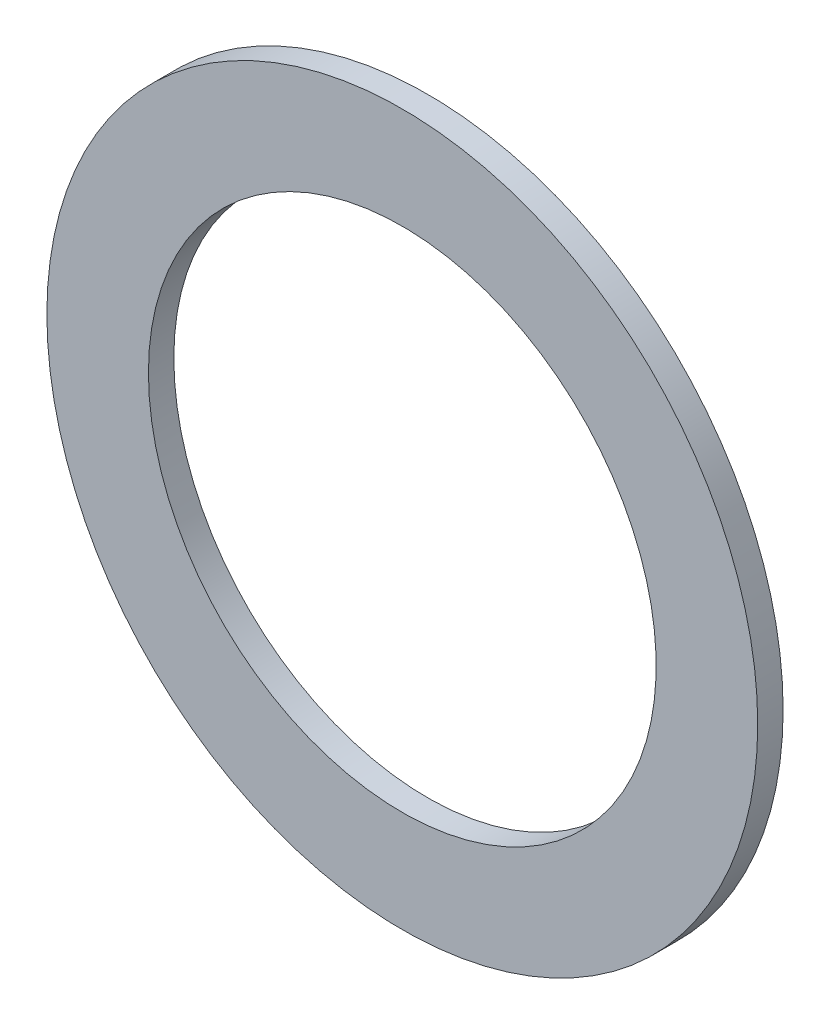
ISO-10303-21;
HEADER;
FILE_DESCRIPTION(('STEP AP214'),'2;1');
FILE_NAME('part.step','',(''),(''),'','','');
FILE_SCHEMA(('AUTOMOTIVE_DESIGN { 1 0 10303 214 1 1 1 1 }'));
ENDSEC;
DATA;
#1=APPLICATION_CONTEXT('core data for automotive mechanical design processes');
#2=APPLICATION_PROTOCOL_DEFINITION('international standard','automotive_design',2000,#1);
#3=PRODUCT_CONTEXT('',#1,'mechanical');
#4=PRODUCT('Part','Part','',(#3));
#5=PRODUCT_RELATED_PRODUCT_CATEGORY('part','',(#4));
#6=PRODUCT_DEFINITION_FORMATION('','',#4);
#7=PRODUCT_DEFINITION_CONTEXT('part definition',#1,'design');
#8=PRODUCT_DEFINITION('design','',#6,#7);
#9=PRODUCT_DEFINITION_SHAPE('','',#8);
#10=(LENGTH_UNIT() NAMED_UNIT(*) SI_UNIT(.MILLI.,.METRE.));
#11=(NAMED_UNIT(*) PLANE_ANGLE_UNIT() SI_UNIT($,.RADIAN.));
#12=(NAMED_UNIT(*) SI_UNIT($,.STERADIAN.) SOLID_ANGLE_UNIT());
#13=UNCERTAINTY_MEASURE_WITH_UNIT(LENGTH_MEASURE(1.E-05),#10,'distance_accuracy_value','');
#14=(GEOMETRIC_REPRESENTATION_CONTEXT(3) GLOBAL_UNCERTAINTY_ASSIGNED_CONTEXT((#13)) GLOBAL_UNIT_ASSIGNED_CONTEXT((#10,
#11,#12)) REPRESENTATION_CONTEXT('',''));
#15=CARTESIAN_POINT('',(0.,0.,0.));
#16=DIRECTION('',(0.,0.,1.));
#17=DIRECTION('',(1.,0.,0.));
#18=AXIS2_PLACEMENT_3D('',#15,#16,#17);
#19=CARTESIAN_POINT('',(0.,0.,3.));
#20=DIRECTION('',(0.,0.,-0.999999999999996));
#21=DIRECTION('',(-1.,0.,0.));
#22=AXIS2_PLACEMENT_3D('',#19,#20,#21);
#23=CYLINDRICAL_SURFACE('',#22,70.);
#24=CARTESIAN_POINT('',(0.,0.,-1.99999999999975));
#25=DIRECTION('',(0.,0.,1.));
#26=DIRECTION('',(1.,0.,0.));
#27=AXIS2_PLACEMENT_3D('',#24,#25,#26);
#28=CIRCLE('',#27,70.);
#29=CARTESIAN_POINT('',(-70.0000000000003,0.,-1.99999999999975));
#30=VERTEX_POINT('',#29);
#31=EDGE_CURVE('E49',#30,#30,#28,.T.);
#32=CARTESIAN_POINT('',(0.,0.,3.));
#33=DIRECTION('',(0.,0.,-0.999999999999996));
#34=DIRECTION('',(-1.,0.,0.));
#35=AXIS2_PLACEMENT_3D('',#32,#33,#34);
#36=CIRCLE('',#35,70.);
#37=CARTESIAN_POINT('',(-70.0000000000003,0.,3.));
#38=VERTEX_POINT('',#37);
#39=EDGE_CURVE('E44',#38,#38,#36,.F.);
#40=CARTESIAN_POINT('',(-70.0000000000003,0.,-1.99999999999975));
#41=CARTESIAN_POINT('',(-70.0000000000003,0.,-1.94791666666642));
#42=CARTESIAN_POINT('',(-70.0000000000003,0.,-1.89583333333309));
#43=CARTESIAN_POINT('',(-70.0000000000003,0.,-1.79166666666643));
#44=CARTESIAN_POINT('',(-70.0000000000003,0.,-1.7395833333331));
#45=CARTESIAN_POINT('',(-70.0000000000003,0.,-1.63541666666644));
#46=CARTESIAN_POINT('',(-70.0000000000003,0.,-1.5833333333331));
#47=CARTESIAN_POINT('',(-70.0000000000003,0.,-1.47916666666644));
#48=CARTESIAN_POINT('',(-70.0000000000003,0.,-1.42708333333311));
#49=CARTESIAN_POINT('',(-70.0000000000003,0.,-1.32291666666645));
#50=CARTESIAN_POINT('',(-70.0000000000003,0.,-1.27083333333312));
#51=CARTESIAN_POINT('',(-70.0000000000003,0.,-1.16666666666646));
#52=CARTESIAN_POINT('',(-70.0000000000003,0.,-1.11458333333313));
#53=CARTESIAN_POINT('',(-70.0000000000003,0.,-1.01041666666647));
#54=CARTESIAN_POINT('',(-70.0000000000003,0.,-0.958333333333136));
#55=CARTESIAN_POINT('',(-70.0000000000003,0.,-0.854166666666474));
#56=CARTESIAN_POINT('',(-70.0000000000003,0.,-0.802083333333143));
#57=CARTESIAN_POINT('',(-70.0000000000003,0.,-0.697916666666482));
#58=CARTESIAN_POINT('',(-70.0000000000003,0.,-0.645833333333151));
#59=CARTESIAN_POINT('',(-70.0000000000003,0.,-0.54166666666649));
#60=CARTESIAN_POINT('',(-70.0000000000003,0.,-0.489583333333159));
#61=CARTESIAN_POINT('',(-70.0000000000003,0.,-0.385416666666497));
#62=CARTESIAN_POINT('',(-70.0000000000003,0.,-0.333333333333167));
#63=CARTESIAN_POINT('',(-70.0000000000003,0.,-0.229166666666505));
#64=CARTESIAN_POINT('',(-70.0000000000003,0.,-0.177083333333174));
#65=CARTESIAN_POINT('',(-70.0000000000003,0.,-0.0729166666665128));
#66=CARTESIAN_POINT('',(-70.0000000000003,0.,-0.020833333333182));
#67=CARTESIAN_POINT('',(-70.0000000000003,0.,0.0833333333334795));
#68=CARTESIAN_POINT('',(-70.0000000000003,0.,0.13541666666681));
#69=CARTESIAN_POINT('',(-70.0000000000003,0.,0.239583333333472));
#70=CARTESIAN_POINT('',(-70.0000000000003,0.,0.291666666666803));
#71=CARTESIAN_POINT('',(-70.0000000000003,0.,0.395833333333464));
#72=CARTESIAN_POINT('',(-70.0000000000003,0.,0.447916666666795));
#73=CARTESIAN_POINT('',(-70.0000000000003,0.,0.552083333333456));
#74=CARTESIAN_POINT('',(-70.0000000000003,0.,0.604166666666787));
#75=CARTESIAN_POINT('',(-70.0000000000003,0.,0.708333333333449));
#76=CARTESIAN_POINT('',(-70.0000000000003,0.,0.76041666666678));
#77=CARTESIAN_POINT('',(-70.0000000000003,0.,0.864583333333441));
#78=CARTESIAN_POINT('',(-70.0000000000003,0.,0.916666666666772));
#79=CARTESIAN_POINT('',(-70.0000000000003,0.,1.02083333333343));
#80=CARTESIAN_POINT('',(-70.0000000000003,0.,1.07291666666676));
#81=CARTESIAN_POINT('',(-70.0000000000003,0.,1.17708333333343));
#82=CARTESIAN_POINT('',(-70.0000000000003,0.,1.22916666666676));
#83=CARTESIAN_POINT('',(-70.0000000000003,0.,1.33333333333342));
#84=CARTESIAN_POINT('',(-70.0000000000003,0.,1.38541666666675));
#85=CARTESIAN_POINT('',(-70.0000000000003,0.,1.48958333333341));
#86=CARTESIAN_POINT('',(-70.0000000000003,0.,1.54166666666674));
#87=CARTESIAN_POINT('',(-70.0000000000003,0.,1.6458333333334));
#88=CARTESIAN_POINT('',(-70.0000000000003,0.,1.69791666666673));
#89=CARTESIAN_POINT('',(-70.0000000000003,0.,1.80208333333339));
#90=CARTESIAN_POINT('',(-70.0000000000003,0.,1.85416666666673));
#91=CARTESIAN_POINT('',(-70.0000000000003,0.,1.95833333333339));
#92=CARTESIAN_POINT('',(-70.0000000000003,0.,2.01041666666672));
#93=CARTESIAN_POINT('',(-70.0000000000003,0.,2.11458333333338));
#94=CARTESIAN_POINT('',(-70.0000000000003,0.,2.16666666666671));
#95=CARTESIAN_POINT('',(-70.0000000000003,0.,2.27083333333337));
#96=CARTESIAN_POINT('',(-70.0000000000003,0.,2.3229166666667));
#97=CARTESIAN_POINT('',(-70.0000000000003,0.,2.42708333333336));
#98=CARTESIAN_POINT('',(-70.0000000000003,0.,2.47916666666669));
#99=CARTESIAN_POINT('',(-70.0000000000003,0.,2.58333333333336));
#100=CARTESIAN_POINT('',(-70.0000000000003,0.,2.63541666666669));
#101=CARTESIAN_POINT('',(-70.0000000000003,0.,2.73958333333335));
#102=CARTESIAN_POINT('',(-70.0000000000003,0.,2.79166666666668));
#103=CARTESIAN_POINT('',(-70.0000000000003,0.,2.89583333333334));
#104=CARTESIAN_POINT('',(-70.0000000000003,0.,2.94791666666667));
#105=CARTESIAN_POINT('',(-70.0000000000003,0.,3.));
#106=B_SPLINE_CURVE_WITH_KNOTS('',3,(#40,#41,#42,#43,#44,#45,#46,#47,#48,#49,#50,#51,#52,#53,
#54,#55,#56,#57,#58,#59,#60,#61,#62,#63,#64,#65,#66,#67,#68,#69,#70,#71,#72,#73,#74,#75,#76,#77,
#78,#79,#80,#81,#82,#83,#84,#85,#86,#87,#88,#89,#90,#91,#92,#93,#94,#95,#96,#97,#98,#99,#100,
#101,#102,#103,#104,#105),.UNSPECIFIED.,.F.,.F.,(4,2,2,2,2,2,2,2,2,2,2,2,2,2,2,2,2,2,2,2,2,2,2,
2,2,2,2,2,2,2,2,2,4),(0.,0.156249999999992,0.312499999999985,0.468749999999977,
0.624999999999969,0.781249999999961,0.937499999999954,1.09374999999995,1.24999999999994,
1.40624999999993,1.56249999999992,1.71874999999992,1.87499999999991,2.0312499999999,
2.18749999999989,2.34374999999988,2.49999999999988,2.65624999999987,2.81249999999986,
2.96874999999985,3.12499999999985,3.28124999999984,3.43749999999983,3.59374999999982,
3.74999999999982,3.90624999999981,4.0624999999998,4.21874999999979,4.37499999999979,
4.53124999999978,4.68749999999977,4.84374999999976,4.99999999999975),.UNSPECIFIED.);
#107=EDGE_CURVE('BSEAM36',#30,#38,#106,.T.);
#108=ORIENTED_EDGE('',*,*,#31,.T.);
#109=ORIENTED_EDGE('',*,*,#39,.F.);
#110=ORIENTED_EDGE('',*,*,#107,.T.);
#111=ORIENTED_EDGE('',*,*,#107,.F.);
#112=EDGE_LOOP('',(#108,#110,#109,#111));
#113=FACE_BOUND('',#112,.T.);
#114=ADVANCED_FACE('F36',(#113),#23,.T.);
#115=CARTESIAN_POINT('',(-70.8400000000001,-70.8400000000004,3.));
#116=DIRECTION('',(0.,0.,0.999999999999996));
#117=DIRECTION('',(1.,0.,0.));
#118=AXIS2_PLACEMENT_3D('',#115,#116,#117);
#119=PLANE('',#118);
#120=CARTESIAN_POINT('',(0.,0.,3.));
#121=DIRECTION('',(0.,0.,-0.999999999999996));
#122=DIRECTION('',(-1.,0.,0.));
#123=AXIS2_PLACEMENT_3D('',#120,#121,#122);
#124=CIRCLE('',#123,50.);
#125=CARTESIAN_POINT('',(-50.0000000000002,0.,3.));
#126=VERTEX_POINT('',#125);
#127=EDGE_CURVE('E10',#126,#126,#124,.F.);
#128=ORIENTED_EDGE('',*,*,#127,.F.);
#129=EDGE_LOOP('',(#128));
#130=FACE_BOUND('',#129,.T.);
#131=ORIENTED_EDGE('',*,*,#39,.T.);
#132=EDGE_LOOP('',(#131));
#133=FACE_BOUND('',#132,.T.);
#134=ADVANCED_FACE('F38',(#130,#133),#119,.T.);
#135=CARTESIAN_POINT('',(0.,0.,3.));
#136=DIRECTION('',(0.,0.,-0.999999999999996));
#137=DIRECTION('',(-1.,0.,0.));
#138=AXIS2_PLACEMENT_3D('',#135,#136,#137);
#139=CYLINDRICAL_SURFACE('',#138,50.);
#140=CARTESIAN_POINT('',(0.,0.,-1.99999999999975));
#141=DIRECTION('',(0.,0.,1.));
#142=DIRECTION('',(1.,0.,0.));
#143=AXIS2_PLACEMENT_3D('',#140,#141,#142);
#144=CIRCLE('',#143,50.);
#145=CARTESIAN_POINT('',(-50.0000000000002,0.,-1.99999999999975));
#146=VERTEX_POINT('',#145);
#147=EDGE_CURVE('E40',#146,#146,#144,.T.);
#148=CARTESIAN_POINT('',(-50.0000000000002,0.,-1.99999999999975));
#149=CARTESIAN_POINT('',(-50.0000000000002,0.,-1.94791666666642));
#150=CARTESIAN_POINT('',(-50.0000000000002,0.,-1.89583333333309));
#151=CARTESIAN_POINT('',(-50.0000000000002,0.,-1.79166666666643));
#152=CARTESIAN_POINT('',(-50.0000000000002,0.,-1.7395833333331));
#153=CARTESIAN_POINT('',(-50.0000000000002,0.,-1.63541666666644));
#154=CARTESIAN_POINT('',(-50.0000000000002,0.,-1.5833333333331));
#155=CARTESIAN_POINT('',(-50.0000000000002,0.,-1.47916666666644));
#156=CARTESIAN_POINT('',(-50.0000000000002,0.,-1.42708333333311));
#157=CARTESIAN_POINT('',(-50.0000000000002,0.,-1.32291666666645));
#158=CARTESIAN_POINT('',(-50.0000000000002,0.,-1.27083333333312));
#159=CARTESIAN_POINT('',(-50.0000000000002,0.,-1.16666666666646));
#160=CARTESIAN_POINT('',(-50.0000000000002,0.,-1.11458333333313));
#161=CARTESIAN_POINT('',(-50.0000000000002,0.,-1.01041666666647));
#162=CARTESIAN_POINT('',(-50.0000000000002,0.,-0.958333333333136));
#163=CARTESIAN_POINT('',(-50.0000000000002,0.,-0.854166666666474));
#164=CARTESIAN_POINT('',(-50.0000000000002,0.,-0.802083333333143));
#165=CARTESIAN_POINT('',(-50.0000000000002,0.,-0.697916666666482));
#166=CARTESIAN_POINT('',(-50.0000000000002,0.,-0.645833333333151));
#167=CARTESIAN_POINT('',(-50.0000000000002,0.,-0.54166666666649));
#168=CARTESIAN_POINT('',(-50.0000000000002,0.,-0.489583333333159));
#169=CARTESIAN_POINT('',(-50.0000000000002,0.,-0.385416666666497));
#170=CARTESIAN_POINT('',(-50.0000000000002,0.,-0.333333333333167));
#171=CARTESIAN_POINT('',(-50.0000000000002,0.,-0.229166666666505));
#172=CARTESIAN_POINT('',(-50.0000000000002,0.,-0.177083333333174));
#173=CARTESIAN_POINT('',(-50.0000000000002,0.,-0.0729166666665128));
#174=CARTESIAN_POINT('',(-50.0000000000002,0.,-0.020833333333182));
#175=CARTESIAN_POINT('',(-50.0000000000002,0.,0.0833333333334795));
#176=CARTESIAN_POINT('',(-50.0000000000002,0.,0.13541666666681));
#177=CARTESIAN_POINT('',(-50.0000000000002,0.,0.239583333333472));
#178=CARTESIAN_POINT('',(-50.0000000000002,0.,0.291666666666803));
#179=CARTESIAN_POINT('',(-50.0000000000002,0.,0.395833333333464));
#180=CARTESIAN_POINT('',(-50.0000000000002,0.,0.447916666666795));
#181=CARTESIAN_POINT('',(-50.0000000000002,0.,0.552083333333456));
#182=CARTESIAN_POINT('',(-50.0000000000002,0.,0.604166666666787));
#183=CARTESIAN_POINT('',(-50.0000000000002,0.,0.708333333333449));
#184=CARTESIAN_POINT('',(-50.0000000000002,0.,0.76041666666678));
#185=CARTESIAN_POINT('',(-50.0000000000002,0.,0.864583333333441));
#186=CARTESIAN_POINT('',(-50.0000000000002,0.,0.916666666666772));
#187=CARTESIAN_POINT('',(-50.0000000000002,0.,1.02083333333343));
#188=CARTESIAN_POINT('',(-50.0000000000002,0.,1.07291666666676));
#189=CARTESIAN_POINT('',(-50.0000000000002,0.,1.17708333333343));
#190=CARTESIAN_POINT('',(-50.0000000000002,0.,1.22916666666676));
#191=CARTESIAN_POINT('',(-50.0000000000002,0.,1.33333333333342));
#192=CARTESIAN_POINT('',(-50.0000000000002,0.,1.38541666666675));
#193=CARTESIAN_POINT('',(-50.0000000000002,0.,1.48958333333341));
#194=CARTESIAN_POINT('',(-50.0000000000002,0.,1.54166666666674));
#195=CARTESIAN_POINT('',(-50.0000000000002,0.,1.6458333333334));
#196=CARTESIAN_POINT('',(-50.0000000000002,0.,1.69791666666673));
#197=CARTESIAN_POINT('',(-50.0000000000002,0.,1.80208333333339));
#198=CARTESIAN_POINT('',(-50.0000000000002,0.,1.85416666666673));
#199=CARTESIAN_POINT('',(-50.0000000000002,0.,1.95833333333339));
#200=CARTESIAN_POINT('',(-50.0000000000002,0.,2.01041666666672));
#201=CARTESIAN_POINT('',(-50.0000000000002,0.,2.11458333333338));
#202=CARTESIAN_POINT('',(-50.0000000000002,0.,2.16666666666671));
#203=CARTESIAN_POINT('',(-50.0000000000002,0.,2.27083333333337));
#204=CARTESIAN_POINT('',(-50.0000000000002,0.,2.3229166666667));
#205=CARTESIAN_POINT('',(-50.0000000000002,0.,2.42708333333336));
#206=CARTESIAN_POINT('',(-50.0000000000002,0.,2.47916666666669));
#207=CARTESIAN_POINT('',(-50.0000000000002,0.,2.58333333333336));
#208=CARTESIAN_POINT('',(-50.0000000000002,0.,2.63541666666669));
#209=CARTESIAN_POINT('',(-50.0000000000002,0.,2.73958333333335));
#210=CARTESIAN_POINT('',(-50.0000000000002,0.,2.79166666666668));
#211=CARTESIAN_POINT('',(-50.0000000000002,0.,2.89583333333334));
#212=CARTESIAN_POINT('',(-50.0000000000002,0.,2.94791666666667));
#213=CARTESIAN_POINT('',(-50.0000000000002,0.,3.));
#214=B_SPLINE_CURVE_WITH_KNOTS('',3,(#148,#149,#150,#151,#152,#153,#154,#155,#156,#157,#158,
#159,#160,#161,#162,#163,#164,#165,#166,#167,#168,#169,#170,#171,#172,#173,#174,#175,#176,#177,
#178,#179,#180,#181,#182,#183,#184,#185,#186,#187,#188,#189,#190,#191,#192,#193,#194,#195,#196,
#197,#198,#199,#200,#201,#202,#203,#204,#205,#206,#207,#208,#209,#210,#211,#212,#213),
.UNSPECIFIED.,.F.,.F.,(4,2,2,2,2,2,2,2,2,2,2,2,2,2,2,2,2,2,2,2,2,2,2,2,2,2,2,2,2,2,2,2,4),(0.,
0.156249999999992,0.312499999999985,0.468749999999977,0.624999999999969,0.781249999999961,
0.937499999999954,1.09374999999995,1.24999999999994,1.40624999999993,1.56249999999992,
1.71874999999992,1.87499999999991,2.0312499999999,2.18749999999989,2.34374999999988,
2.49999999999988,2.65624999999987,2.81249999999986,2.96874999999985,3.12499999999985,
3.28124999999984,3.43749999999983,3.59374999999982,3.74999999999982,3.90624999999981,
4.0624999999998,4.21874999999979,4.37499999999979,4.53124999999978,4.68749999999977,
4.84374999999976,4.99999999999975),.UNSPECIFIED.);
#215=EDGE_CURVE('BSEAM60',#146,#126,#214,.T.);
#216=ORIENTED_EDGE('',*,*,#147,.F.);
#217=ORIENTED_EDGE('',*,*,#127,.T.);
#218=ORIENTED_EDGE('',*,*,#215,.T.);
#219=ORIENTED_EDGE('',*,*,#215,.F.);
#220=EDGE_LOOP('',(#216,#218,#217,#219));
#221=FACE_BOUND('',#220,.T.);
#222=ADVANCED_FACE('F60',(#221),#139,.F.);
#223=CARTESIAN_POINT('',(-134.848243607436,-140.930319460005,-1.99999999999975));
#224=DIRECTION('',(0.,0.,1.));
#225=DIRECTION('',(1.,0.,0.));
#226=AXIS2_PLACEMENT_3D('',#223,#224,#225);
#227=PLANE('',#226);
#228=ORIENTED_EDGE('',*,*,#147,.T.);
#229=EDGE_LOOP('',(#228));
#230=FACE_BOUND('',#229,.T.);
#231=ORIENTED_EDGE('',*,*,#31,.F.);
#232=EDGE_LOOP('',(#231));
#233=FACE_BOUND('',#232,.T.);
#234=ADVANCED_FACE('F57',(#230,#233),#227,.F.);
#235=CLOSED_SHELL('',(#114,#134,#222,#234));
#236=MANIFOLD_SOLID_BREP('B2',#235);
#237=ADVANCED_BREP_SHAPE_REPRESENTATION('',(#18,#236),#14);
#238=SHAPE_DEFINITION_REPRESENTATION(#9,#237);
ENDSEC;
END-ISO-10303-21;
